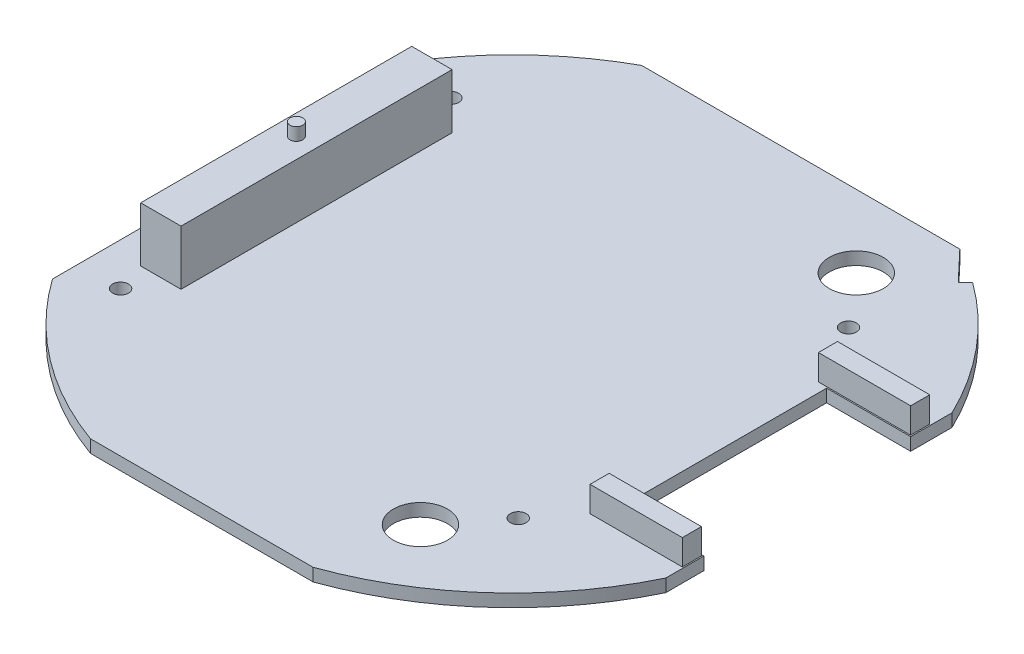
ISO-10303-21;
HEADER;
FILE_DESCRIPTION(('STEP AP214'),'2;1');
FILE_NAME('part.step','',(''),(''),'','','');
FILE_SCHEMA(('AUTOMOTIVE_DESIGN { 1 0 10303 214 1 1 1 1 }'));
ENDSEC;
DATA;
#1=APPLICATION_CONTEXT('core data for automotive mechanical design processes');
#2=APPLICATION_PROTOCOL_DEFINITION('international standard','automotive_design',2000,#1);
#3=PRODUCT_CONTEXT('',#1,'mechanical');
#4=PRODUCT('Part','Part','',(#3));
#5=PRODUCT_RELATED_PRODUCT_CATEGORY('part','',(#4));
#6=PRODUCT_DEFINITION_FORMATION('','',#4);
#7=PRODUCT_DEFINITION_CONTEXT('part definition',#1,'design');
#8=PRODUCT_DEFINITION('design','',#6,#7);
#9=PRODUCT_DEFINITION_SHAPE('','',#8);
#10=(LENGTH_UNIT() NAMED_UNIT(*) SI_UNIT(.MILLI.,.METRE.));
#11=(NAMED_UNIT(*) PLANE_ANGLE_UNIT() SI_UNIT($,.RADIAN.));
#12=(NAMED_UNIT(*) SI_UNIT($,.STERADIAN.) SOLID_ANGLE_UNIT());
#13=UNCERTAINTY_MEASURE_WITH_UNIT(LENGTH_MEASURE(1.E-05),#10,'distance_accuracy_value','');
#14=(GEOMETRIC_REPRESENTATION_CONTEXT(3) GLOBAL_UNCERTAINTY_ASSIGNED_CONTEXT((#13)) GLOBAL_UNIT_ASSIGNED_CONTEXT((#10,
#11,#12)) REPRESENTATION_CONTEXT('',''));
#15=CARTESIAN_POINT('',(0.,0.,0.));
#16=DIRECTION('',(0.,0.,1.));
#17=DIRECTION('',(1.,0.,0.));
#18=AXIS2_PLACEMENT_3D('',#15,#16,#17);
#19=CARTESIAN_POINT('',(0.,13.462,0.));
#20=DIRECTION('',(0.,1.,0.));
#21=DIRECTION('',(0.,0.,1.));
#22=AXIS2_PLACEMENT_3D('',#19,#20,#21);
#23=PLANE('',#22);
#24=DIRECTION('',(0.,0.,1.));
#25=VECTOR('',#24,1.);
#26=CARTESIAN_POINT('',(-47.0769015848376,13.462,-27.051));
#27=LINE('',#26,#25);
#28=CARTESIAN_POINT('',(-47.0769015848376,13.462,-27.051));
#29=VERTEX_POINT('',#28);
#30=CARTESIAN_POINT('',(-47.0769015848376,13.462,27.051));
#31=VERTEX_POINT('',#30);
#32=EDGE_CURVE('E295',#29,#31,#27,.T.);
#33=ORIENTED_EDGE('',*,*,#32,.T.);
#34=DIRECTION('',(1.,0.,0.));
#35=VECTOR('',#34,1.);
#36=CARTESIAN_POINT('',(-47.0769015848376,13.462,27.051));
#37=LINE('',#36,#35);
#38=CARTESIAN_POINT('',(-39.0251015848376,13.462,27.051));
#39=VERTEX_POINT('',#38);
#40=EDGE_CURVE('E298',#31,#39,#37,.T.);
#41=ORIENTED_EDGE('',*,*,#40,.T.);
#42=DIRECTION('',(0.,0.,-1.));
#43=VECTOR('',#42,1.);
#44=CARTESIAN_POINT('',(-39.0251015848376,13.462,-27.051));
#45=LINE('',#44,#43);
#46=CARTESIAN_POINT('',(-39.0251015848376,13.462,-27.051));
#47=VERTEX_POINT('',#46);
#48=EDGE_CURVE('E301',#39,#47,#45,.T.);
#49=ORIENTED_EDGE('',*,*,#48,.T.);
#50=DIRECTION('',(-1.,0.,0.));
#51=VECTOR('',#50,1.);
#52=CARTESIAN_POINT('',(-47.0769015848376,13.462,-27.051));
#53=LINE('',#52,#51);
#54=EDGE_CURVE('E303',#47,#29,#53,.T.);
#55=ORIENTED_EDGE('',*,*,#54,.T.);
#56=EDGE_LOOP('',(#33,#41,#49,#55));
#57=FACE_BOUND('',#56,.T.);
#58=CARTESIAN_POINT('',(-43.0510015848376,13.462,0.));
#59=DIRECTION('',(0.,1.,0.));
#60=DIRECTION('',(0.,0.,1.));
#61=AXIS2_PLACEMENT_3D('',#58,#59,#60);
#62=CIRCLE('',#61,1.27);
#63=CARTESIAN_POINT('',(-43.0510015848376,13.462,1.27));
#64=VERTEX_POINT('',#63);
#65=EDGE_CURVE('E978',#64,#64,#62,.T.);
#66=ORIENTED_EDGE('',*,*,#65,.F.);
#67=EDGE_LOOP('',(#66));
#68=FACE_BOUND('',#67,.T.);
#69=ADVANCED_FACE('F32',(#57,#68),#23,.T.);
#70=CARTESIAN_POINT('',(0.,2.54,0.));
#71=DIRECTION('',(0.,1.,0.));
#72=DIRECTION('',(0.,0.,1.));
#73=AXIS2_PLACEMENT_3D('',#70,#71,#72);
#74=PLANE('',#73);
#75=CARTESIAN_POINT('',(25.5374462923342,2.54,43.8277));
#76=DIRECTION('',(0.,1.,0.));
#77=DIRECTION('',(0.,0.,1.));
#78=AXIS2_PLACEMENT_3D('',#75,#76,#77);
#79=CIRCLE('',#78,5.3975);
#80=CARTESIAN_POINT('',(25.5374462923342,2.54,49.2252));
#81=VERTEX_POINT('',#80);
#82=EDGE_CURVE('E970',#81,#81,#79,.T.);
#83=ORIENTED_EDGE('',*,*,#82,.F.);
#84=EDGE_LOOP('',(#83));
#85=FACE_BOUND('',#84,.T.);
#86=CARTESIAN_POINT('',(25.5374462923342,2.54,-43.1673));
#87=DIRECTION('',(0.,1.,0.));
#88=DIRECTION('',(0.,0.,1.));
#89=AXIS2_PLACEMENT_3D('',#86,#87,#88);
#90=CIRCLE('',#89,5.3975);
#91=CARTESIAN_POINT('',(25.5374462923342,2.54,-37.7698));
#92=VERTEX_POINT('',#91);
#93=EDGE_CURVE('E972',#92,#92,#90,.T.);
#94=ORIENTED_EDGE('',*,*,#93,.F.);
#95=EDGE_LOOP('',(#94));
#96=FACE_BOUND('',#95,.T.);
#97=DIRECTION('',(1.,0.,0.));
#98=VECTOR('',#97,1.);
#99=CARTESIAN_POINT('',(40.5869462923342,2.54,-20.5486));
#100=LINE('',#99,#98);
#101=CARTESIAN_POINT('',(40.5869462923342,2.54,-20.5486));
#102=VERTEX_POINT('',#101);
#103=CARTESIAN_POINT('',(59.0019462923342,2.54,-20.5486));
#104=VERTEX_POINT('',#103);
#105=EDGE_CURVE('E267',#102,#104,#100,.T.);
#106=ORIENTED_EDGE('',*,*,#105,.F.);
#107=DIRECTION('',(0.,0.,1.));
#108=VECTOR('',#107,1.);
#109=CARTESIAN_POINT('',(40.5869462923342,2.54,-24.3586));
#110=LINE('',#109,#108);
#111=CARTESIAN_POINT('',(40.5869462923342,2.54,-24.3586));
#112=VERTEX_POINT('',#111);
#113=EDGE_CURVE('E264',#112,#102,#110,.T.);
#114=ORIENTED_EDGE('',*,*,#113,.F.);
#115=DIRECTION('',(-1.,0.,0.));
#116=VECTOR('',#115,1.);
#117=CARTESIAN_POINT('',(40.5869462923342,2.54,-24.3586));
#118=LINE('',#117,#116);
#119=CARTESIAN_POINT('',(59.0019462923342,2.54,-24.3586));
#120=VERTEX_POINT('',#119);
#121=EDGE_CURVE('E276',#120,#112,#118,.T.);
#122=ORIENTED_EDGE('',*,*,#121,.F.);
#123=DIRECTION('',(0.,0.,-1.));
#124=VECTOR('',#123,1.);
#125=CARTESIAN_POINT('',(59.0019462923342,2.54,-24.3586));
#126=LINE('',#125,#124);
#127=EDGE_CURVE('E284',#104,#120,#126,.T.);
#128=ORIENTED_EDGE('',*,*,#127,.F.);
#129=EDGE_LOOP('',(#106,#114,#122,#128));
#130=FACE_BOUND('',#129,.T.);
#131=DIRECTION('',(0.,0.,1.));
#132=VECTOR('',#131,1.);
#133=CARTESIAN_POINT('',(-47.0769015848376,2.54,-27.051));
#134=LINE('',#133,#132);
#135=CARTESIAN_POINT('',(-47.0769015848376,2.54,-27.051));
#136=VERTEX_POINT('',#135);
#137=CARTESIAN_POINT('',(-47.0769015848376,2.54,-3.11458275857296));
#138=VERTEX_POINT('',#137);
#139=EDGE_CURVE('E42',#136,#138,#134,.T.);
#140=ORIENTED_EDGE('',*,*,#139,.F.);
#141=DIRECTION('',(-1.,0.,0.));
#142=VECTOR('',#141,1.);
#143=CARTESIAN_POINT('',(-47.0769015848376,2.54,-27.051));
#144=LINE('',#143,#142);
#145=CARTESIAN_POINT('',(-39.0251015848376,2.54,-27.051));
#146=VERTEX_POINT('',#145);
#147=EDGE_CURVE('E299',#146,#136,#144,.T.);
#148=ORIENTED_EDGE('',*,*,#147,.F.);
#149=DIRECTION('',(0.,0.,-1.));
#150=VECTOR('',#149,1.);
#151=CARTESIAN_POINT('',(-39.0251015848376,2.54,-27.051));
#152=LINE('',#151,#150);
#153=CARTESIAN_POINT('',(-39.0251015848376,2.54,27.051));
#154=VERTEX_POINT('',#153);
#155=EDGE_CURVE('E310',#154,#146,#152,.T.);
#156=ORIENTED_EDGE('',*,*,#155,.F.);
#157=DIRECTION('',(1.,0.,0.));
#158=VECTOR('',#157,1.);
#159=CARTESIAN_POINT('',(-47.0769015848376,2.54,27.051));
#160=LINE('',#159,#158);
#161=CARTESIAN_POINT('',(-47.0769015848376,2.54,27.051));
#162=VERTEX_POINT('',#161);
#163=EDGE_CURVE('E307',#162,#154,#160,.T.);
#164=ORIENTED_EDGE('',*,*,#163,.F.);
#165=CARTESIAN_POINT('',(-47.0769015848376,2.54,3.11458275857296));
#166=VERTEX_POINT('',#165);
#167=EDGE_CURVE('E11',#166,#162,#134,.T.);
#168=ORIENTED_EDGE('',*,*,#167,.F.);
#169=CARTESIAN_POINT('',(-51.0901015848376,2.54,0.));
#170=DIRECTION('',(0.,-1.,0.));
#171=DIRECTION('',(0.,0.,1.));
#172=AXIS2_PLACEMENT_3D('',#169,#170,#171);
#173=CIRCLE('',#172,5.08000000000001);
#174=CARTESIAN_POINT('',(-51.0901015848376,2.54,5.08));
#175=VERTEX_POINT('',#174);
#176=EDGE_CURVE('E367',#166,#175,#173,.T.);
#177=ORIENTED_EDGE('',*,*,#176,.T.);
#178=DIRECTION('',(-1.,0.,0.));
#179=VECTOR('',#178,1.);
#180=CARTESIAN_POINT('',(-53.6301015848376,2.54,5.08));
#181=LINE('',#180,#179);
#182=CARTESIAN_POINT('',(-53.6301015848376,2.54,5.08));
#183=VERTEX_POINT('',#182);
#184=EDGE_CURVE('E371',#175,#183,#181,.T.);
#185=ORIENTED_EDGE('',*,*,#184,.T.);
#186=DIRECTION('',(0.,0.,1.));
#187=VECTOR('',#186,1.);
#188=CARTESIAN_POINT('',(-53.6301015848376,2.54,5.08));
#189=LINE('',#188,#187);
#190=CARTESIAN_POINT('',(-53.6301015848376,2.54,38.1));
#191=VERTEX_POINT('',#190);
#192=EDGE_CURVE('E374',#183,#191,#189,.T.);
#193=ORIENTED_EDGE('',*,*,#192,.T.);
#194=CARTESIAN_POINT('',(0.,2.54,0.));
#195=DIRECTION('',(0.,1.,0.));
#196=DIRECTION('',(0.,0.,1.));
#197=AXIS2_PLACEMENT_3D('',#194,#195,#196);
#198=CIRCLE('',#197,65.786);
#199=CARTESIAN_POINT('',(-22.225,2.54,61.918068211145));
#200=VERTEX_POINT('',#199);
#201=EDGE_CURVE('E376',#191,#200,#198,.T.);
#202=ORIENTED_EDGE('',*,*,#201,.T.);
#203=DIRECTION('',(1.,0.,0.));
#204=VECTOR('',#203,1.);
#205=CARTESIAN_POINT('',(-22.225,2.54,61.918068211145));
#206=LINE('',#205,#204);
#207=CARTESIAN_POINT('',(22.225,2.54,61.918068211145));
#208=VERTEX_POINT('',#207);
#209=EDGE_CURVE('E378',#200,#208,#206,.T.);
#210=ORIENTED_EDGE('',*,*,#209,.T.);
#211=CARTESIAN_POINT('',(0.,2.54,0.));
#212=DIRECTION('',(0.,1.,0.));
#213=DIRECTION('',(0.,0.,1.));
#214=AXIS2_PLACEMENT_3D('',#211,#212,#213);
#215=CIRCLE('',#214,65.786);
#216=CARTESIAN_POINT('',(59.2559462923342,2.54,28.575));
#217=VERTEX_POINT('',#216);
#218=EDGE_CURVE('E380',#208,#217,#215,.T.);
#219=ORIENTED_EDGE('',*,*,#218,.T.);
#220=DIRECTION('',(0.,0.,-1.));
#221=VECTOR('',#220,1.);
#222=CARTESIAN_POINT('',(59.2559462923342,2.54,20.955));
#223=LINE('',#222,#221);
#224=CARTESIAN_POINT('',(59.2559462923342,2.54,20.955));
#225=VERTEX_POINT('',#224);
#226=EDGE_CURVE('E382',#217,#225,#223,.T.);
#227=ORIENTED_EDGE('',*,*,#226,.T.);
#228=DIRECTION('',(-1.,0.,0.));
#229=VECTOR('',#228,1.);
#230=CARTESIAN_POINT('',(42.4919462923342,2.54,20.955));
#231=LINE('',#230,#229);
#232=CARTESIAN_POINT('',(42.4919462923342,2.54,20.955));
#233=VERTEX_POINT('',#232);
#234=EDGE_CURVE('E384',#225,#233,#231,.T.);
#235=ORIENTED_EDGE('',*,*,#234,.T.);
#236=DIRECTION('',(0.,0.,-1.));
#237=VECTOR('',#236,1.);
#238=CARTESIAN_POINT('',(42.4919462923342,2.54,-20.2946));
#239=LINE('',#238,#237);
#240=CARTESIAN_POINT('',(42.4919462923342,2.54,-20.2946));
#241=VERTEX_POINT('',#240);
#242=EDGE_CURVE('E386',#233,#241,#239,.T.);
#243=ORIENTED_EDGE('',*,*,#242,.T.);
#244=DIRECTION('',(1.,0.,0.));
#245=VECTOR('',#244,1.);
#246=CARTESIAN_POINT('',(59.2559462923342,2.54,-20.2946));
#247=LINE('',#246,#245);
#248=CARTESIAN_POINT('',(59.2559462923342,2.54,-20.2946));
#249=VERTEX_POINT('',#248);
#250=EDGE_CURVE('E388',#241,#249,#247,.T.);
#251=ORIENTED_EDGE('',*,*,#250,.T.);
#252=DIRECTION('',(0.,0.,-1.));
#253=VECTOR('',#252,1.);
#254=CARTESIAN_POINT('',(59.2559462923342,2.54,-28.575));
#255=LINE('',#254,#253);
#256=CARTESIAN_POINT('',(59.2559462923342,2.54,-28.575));
#257=VERTEX_POINT('',#256);
#258=EDGE_CURVE('E390',#249,#257,#255,.T.);
#259=ORIENTED_EDGE('',*,*,#258,.T.);
#260=CARTESIAN_POINT('',(0.,2.54,0.));
#261=DIRECTION('',(0.,1.,0.));
#262=DIRECTION('',(0.,0.,1.));
#263=AXIS2_PLACEMENT_3D('',#260,#261,#262);
#264=CIRCLE('',#263,65.786);
#265=CARTESIAN_POINT('',(38.8154375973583,2.54,-53.1145893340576));
#266=VERTEX_POINT('',#265);
#267=EDGE_CURVE('E351',#257,#266,#264,.T.);
#268=ORIENTED_EDGE('',*,*,#267,.T.);
#269=DIRECTION('',(-0.725904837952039,0.,0.687795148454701));
#270=VECTOR('',#269,1.);
#271=CARTESIAN_POINT('',(37.3403989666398,2.54,-51.7169895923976));
#272=LINE('',#271,#270);
#273=CARTESIAN_POINT('',(37.3403989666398,2.54,-51.7169895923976));
#274=VERTEX_POINT('',#273);
#275=EDGE_CURVE('E354',#266,#274,#272,.T.);
#276=ORIENTED_EDGE('',*,*,#275,.T.);
#277=DIRECTION('',(-0.687795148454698,0.,-0.725904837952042));
#278=VECTOR('',#277,1.);
#279=CARTESIAN_POINT('',(31.75,2.54,-57.6171441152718));
#280=LINE('',#279,#278);
#281=CARTESIAN_POINT('',(31.75,2.54,-57.6171441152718));
#282=VERTEX_POINT('',#281);
#283=EDGE_CURVE('E357',#274,#282,#280,.T.);
#284=ORIENTED_EDGE('',*,*,#283,.T.);
#285=DIRECTION('',(-1.,0.,0.));
#286=VECTOR('',#285,1.);
#287=CARTESIAN_POINT('',(-31.75,2.54,-57.6171441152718));
#288=LINE('',#287,#286);
#289=CARTESIAN_POINT('',(-31.75,2.54,-57.6171441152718));
#290=VERTEX_POINT('',#289);
#291=EDGE_CURVE('E359',#282,#290,#288,.T.);
#292=ORIENTED_EDGE('',*,*,#291,.T.);
#293=CARTESIAN_POINT('',(0.,2.54,0.));
#294=DIRECTION('',(0.,1.,0.));
#295=DIRECTION('',(0.,0.,1.));
#296=AXIS2_PLACEMENT_3D('',#293,#294,#295);
#297=CIRCLE('',#296,65.786);
#298=CARTESIAN_POINT('',(-53.6301015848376,2.54,-38.1));
#299=VERTEX_POINT('',#298);
#300=EDGE_CURVE('E361',#290,#299,#297,.T.);
#301=ORIENTED_EDGE('',*,*,#300,.T.);
#302=DIRECTION('',(0.,0.,1.));
#303=VECTOR('',#302,1.);
#304=CARTESIAN_POINT('',(-53.6301015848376,2.54,-38.1));
#305=LINE('',#304,#303);
#306=CARTESIAN_POINT('',(-53.6301015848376,2.54,-5.08000000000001));
#307=VERTEX_POINT('',#306);
#308=EDGE_CURVE('E363',#299,#307,#305,.T.);
#309=ORIENTED_EDGE('',*,*,#308,.T.);
#310=DIRECTION('',(1.,0.,0.));
#311=VECTOR('',#310,1.);
#312=CARTESIAN_POINT('',(-51.0901015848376,2.54,-5.08000000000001));
#313=LINE('',#312,#311);
#314=CARTESIAN_POINT('',(-51.0901015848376,2.54,-5.08000000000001));
#315=VERTEX_POINT('',#314);
#316=EDGE_CURVE('E365',#307,#315,#313,.T.);
#317=ORIENTED_EDGE('',*,*,#316,.T.);
#318=EDGE_CURVE('E368',#315,#138,#173,.T.);
#319=ORIENTED_EDGE('',*,*,#318,.T.);
#320=EDGE_LOOP('',(#140,#148,#156,#164,#168,#177,#185,#193,#202,#210,#219,#227,#235,#243,#251,
#259,#268,#276,#284,#292,#301,#309,#317,#319));
#321=FACE_BOUND('',#320,.T.);
#322=CARTESIAN_POINT('',(34.1903984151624,2.54,-32.9565));
#323=DIRECTION('',(0.,1.,0.));
#324=DIRECTION('',(0.,0.,1.));
#325=AXIS2_PLACEMENT_3D('',#322,#323,#324);
#326=CIRCLE('',#325,1.5875);
#327=CARTESIAN_POINT('',(34.1903984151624,2.54,-31.369));
#328=VERTEX_POINT('',#327);
#329=EDGE_CURVE('E333',#328,#328,#326,.T.);
#330=ORIENTED_EDGE('',*,*,#329,.F.);
#331=EDGE_LOOP('',(#330));
#332=FACE_BOUND('',#331,.T.);
#333=CARTESIAN_POINT('',(-45.1846015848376,2.54,-32.9565));
#334=DIRECTION('',(0.,1.,0.));
#335=DIRECTION('',(0.,0.,1.));
#336=AXIS2_PLACEMENT_3D('',#333,#334,#335);
#337=CIRCLE('',#336,1.5875);
#338=CARTESIAN_POINT('',(-45.1846015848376,2.54,-31.369));
#339=VERTEX_POINT('',#338);
#340=EDGE_CURVE('E345',#339,#339,#337,.T.);
#341=ORIENTED_EDGE('',*,*,#340,.F.);
#342=EDGE_LOOP('',(#341));
#343=FACE_BOUND('',#342,.T.);
#344=CARTESIAN_POINT('',(-45.1846015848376,2.54,32.9565));
#345=DIRECTION('',(0.,1.,0.));
#346=DIRECTION('',(0.,0.,1.));
#347=AXIS2_PLACEMENT_3D('',#344,#345,#346);
#348=CIRCLE('',#347,1.5875);
#349=CARTESIAN_POINT('',(-45.1846015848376,2.54,34.544));
#350=VERTEX_POINT('',#349);
#351=EDGE_CURVE('E339',#350,#350,#348,.T.);
#352=ORIENTED_EDGE('',*,*,#351,.F.);
#353=EDGE_LOOP('',(#352));
#354=FACE_BOUND('',#353,.T.);
#355=CARTESIAN_POINT('',(34.1903984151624,2.54,32.9565));
#356=DIRECTION('',(0.,1.,0.));
#357=DIRECTION('',(0.,0.,1.));
#358=AXIS2_PLACEMENT_3D('',#355,#356,#357);
#359=CIRCLE('',#358,1.5875);
#360=CARTESIAN_POINT('',(34.1903984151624,2.54,34.544));
#361=VERTEX_POINT('',#360);
#362=EDGE_CURVE('E327',#361,#361,#359,.T.);
#363=ORIENTED_EDGE('',*,*,#362,.F.);
#364=EDGE_LOOP('',(#363));
#365=FACE_BOUND('',#364,.T.);
#366=DIRECTION('',(1.,0.,0.));
#367=VECTOR('',#366,1.);
#368=CARTESIAN_POINT('',(40.5869462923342,2.54,25.019));
#369=LINE('',#368,#367);
#370=CARTESIAN_POINT('',(40.5869462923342,2.54,25.019));
#371=VERTEX_POINT('',#370);
#372=CARTESIAN_POINT('',(59.0019462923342,2.54,25.019));
#373=VERTEX_POINT('',#372);
#374=EDGE_CURVE('E990',#371,#373,#369,.T.);
#375=ORIENTED_EDGE('',*,*,#374,.F.);
#376=DIRECTION('',(0.,0.,1.));
#377=VECTOR('',#376,1.);
#378=CARTESIAN_POINT('',(40.5869462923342,2.54,25.019));
#379=LINE('',#378,#377);
#380=CARTESIAN_POINT('',(40.5869462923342,2.54,21.209));
#381=VERTEX_POINT('',#380);
#382=EDGE_CURVE('E262',#381,#371,#379,.T.);
#383=ORIENTED_EDGE('',*,*,#382,.F.);
#384=DIRECTION('',(-1.,0.,0.));
#385=VECTOR('',#384,1.);
#386=CARTESIAN_POINT('',(40.5869462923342,2.54,21.209));
#387=LINE('',#386,#385);
#388=CARTESIAN_POINT('',(59.0019462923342,2.54,21.209));
#389=VERTEX_POINT('',#388);
#390=EDGE_CURVE('E258',#389,#381,#387,.T.);
#391=ORIENTED_EDGE('',*,*,#390,.F.);
#392=DIRECTION('',(0.,0.,-1.));
#393=VECTOR('',#392,1.);
#394=CARTESIAN_POINT('',(59.0019462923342,2.54,25.019));
#395=LINE('',#394,#393);
#396=EDGE_CURVE('E992',#373,#389,#395,.T.);
#397=ORIENTED_EDGE('',*,*,#396,.F.);
#398=EDGE_LOOP('',(#375,#383,#391,#397));
#399=FACE_BOUND('',#398,.T.);
#400=ADVANCED_FACE('F503',(#85,#96,#130,#321,#332,#343,#354,#365,#399),#74,.T.);
#401=CARTESIAN_POINT('',(0.,0.,0.));
#402=DIRECTION('',(0.,1.,0.));
#403=DIRECTION('',(0.,0.,1.));
#404=AXIS2_PLACEMENT_3D('',#401,#402,#403);
#405=PLANE('',#404);
#406=CARTESIAN_POINT('',(25.5374462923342,0.,43.8277));
#407=DIRECTION('',(0.,1.,0.));
#408=DIRECTION('',(0.,0.,1.));
#409=AXIS2_PLACEMENT_3D('',#406,#407,#408);
#410=CIRCLE('',#409,5.3975);
#411=CARTESIAN_POINT('',(25.5374462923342,0.,49.2252));
#412=VERTEX_POINT('',#411);
#413=EDGE_CURVE('E967',#412,#412,#410,.T.);
#414=ORIENTED_EDGE('',*,*,#413,.T.);
#415=EDGE_LOOP('',(#414));
#416=FACE_BOUND('',#415,.T.);
#417=CARTESIAN_POINT('',(25.5374462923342,0.,-43.1673));
#418=DIRECTION('',(0.,1.,0.));
#419=DIRECTION('',(0.,0.,1.));
#420=AXIS2_PLACEMENT_3D('',#417,#418,#419);
#421=CIRCLE('',#420,5.3975);
#422=CARTESIAN_POINT('',(25.5374462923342,0.,-37.7698));
#423=VERTEX_POINT('',#422);
#424=EDGE_CURVE('E975',#423,#423,#421,.T.);
#425=ORIENTED_EDGE('',*,*,#424,.T.);
#426=EDGE_LOOP('',(#425));
#427=FACE_BOUND('',#426,.T.);
#428=CARTESIAN_POINT('',(34.1903984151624,0.,-32.9565));
#429=DIRECTION('',(0.,1.,0.));
#430=DIRECTION('',(0.,0.,1.));
#431=AXIS2_PLACEMENT_3D('',#428,#429,#430);
#432=CIRCLE('',#431,1.5875);
#433=CARTESIAN_POINT('',(34.1903984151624,0.,-31.369));
#434=VERTEX_POINT('',#433);
#435=EDGE_CURVE('E330',#434,#434,#432,.T.);
#436=ORIENTED_EDGE('',*,*,#435,.T.);
#437=EDGE_LOOP('',(#436));
#438=FACE_BOUND('',#437,.T.);
#439=CARTESIAN_POINT('',(-45.1846015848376,0.,-32.9565));
#440=DIRECTION('',(0.,1.,0.));
#441=DIRECTION('',(0.,0.,1.));
#442=AXIS2_PLACEMENT_3D('',#439,#440,#441);
#443=CIRCLE('',#442,1.5875);
#444=CARTESIAN_POINT('',(-45.1846015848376,0.,-31.369));
#445=VERTEX_POINT('',#444);
#446=EDGE_CURVE('E342',#445,#445,#443,.T.);
#447=ORIENTED_EDGE('',*,*,#446,.T.);
#448=EDGE_LOOP('',(#447));
#449=FACE_BOUND('',#448,.T.);
#450=CARTESIAN_POINT('',(0.,0.,0.));
#451=DIRECTION('',(0.,1.,0.));
#452=DIRECTION('',(0.,0.,1.));
#453=AXIS2_PLACEMENT_3D('',#450,#451,#452);
#454=CIRCLE('',#453,65.786);
#455=CARTESIAN_POINT('',(59.2559462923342,0.,-28.575));
#456=VERTEX_POINT('',#455);
#457=CARTESIAN_POINT('',(38.8154375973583,0.,-53.1145893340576));
#458=VERTEX_POINT('',#457);
#459=EDGE_CURVE('E348',#456,#458,#454,.T.);
#460=ORIENTED_EDGE('',*,*,#459,.F.);
#461=DIRECTION('',(0.,0.,-1.));
#462=VECTOR('',#461,1.);
#463=CARTESIAN_POINT('',(59.2559462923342,0.,-28.575));
#464=LINE('',#463,#462);
#465=CARTESIAN_POINT('',(59.2559462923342,0.,-20.2946));
#466=VERTEX_POINT('',#465);
#467=EDGE_CURVE('E355',#466,#456,#464,.T.);
#468=ORIENTED_EDGE('',*,*,#467,.F.);
#469=DIRECTION('',(1.,0.,0.));
#470=VECTOR('',#469,1.);
#471=CARTESIAN_POINT('',(59.2559462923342,0.,-20.2946));
#472=LINE('',#471,#470);
#473=CARTESIAN_POINT('',(42.4919462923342,0.,-20.2946));
#474=VERTEX_POINT('',#473);
#475=EDGE_CURVE('E425',#474,#466,#472,.T.);
#476=ORIENTED_EDGE('',*,*,#475,.F.);
#477=DIRECTION('',(0.,0.,-1.));
#478=VECTOR('',#477,1.);
#479=CARTESIAN_POINT('',(42.4919462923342,0.,-20.2946));
#480=LINE('',#479,#478);
#481=CARTESIAN_POINT('',(42.4919462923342,0.,20.955));
#482=VERTEX_POINT('',#481);
#483=EDGE_CURVE('E423',#482,#474,#480,.T.);
#484=ORIENTED_EDGE('',*,*,#483,.F.);
#485=DIRECTION('',(-1.,0.,0.));
#486=VECTOR('',#485,1.);
#487=CARTESIAN_POINT('',(42.4919462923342,0.,20.955));
#488=LINE('',#487,#486);
#489=CARTESIAN_POINT('',(59.2559462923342,0.,20.955));
#490=VERTEX_POINT('',#489);
#491=EDGE_CURVE('E421',#490,#482,#488,.T.);
#492=ORIENTED_EDGE('',*,*,#491,.F.);
#493=DIRECTION('',(0.,0.,-1.));
#494=VECTOR('',#493,1.);
#495=CARTESIAN_POINT('',(59.2559462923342,0.,20.955));
#496=LINE('',#495,#494);
#497=CARTESIAN_POINT('',(59.2559462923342,0.,28.575));
#498=VERTEX_POINT('',#497);
#499=EDGE_CURVE('E419',#498,#490,#496,.T.);
#500=ORIENTED_EDGE('',*,*,#499,.F.);
#501=CARTESIAN_POINT('',(0.,0.,0.));
#502=DIRECTION('',(0.,1.,0.));
#503=DIRECTION('',(0.,0.,1.));
#504=AXIS2_PLACEMENT_3D('',#501,#502,#503);
#505=CIRCLE('',#504,65.786);
#506=CARTESIAN_POINT('',(22.225,0.,61.918068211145));
#507=VERTEX_POINT('',#506);
#508=EDGE_CURVE('E417',#507,#498,#505,.T.);
#509=ORIENTED_EDGE('',*,*,#508,.F.);
#510=DIRECTION('',(1.,0.,0.));
#511=VECTOR('',#510,1.);
#512=CARTESIAN_POINT('',(-22.225,0.,61.918068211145));
#513=LINE('',#512,#511);
#514=CARTESIAN_POINT('',(-22.225,0.,61.918068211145));
#515=VERTEX_POINT('',#514);
#516=EDGE_CURVE('E415',#515,#507,#513,.T.);
#517=ORIENTED_EDGE('',*,*,#516,.F.);
#518=CARTESIAN_POINT('',(0.,0.,0.));
#519=DIRECTION('',(0.,1.,0.));
#520=DIRECTION('',(0.,0.,1.));
#521=AXIS2_PLACEMENT_3D('',#518,#519,#520);
#522=CIRCLE('',#521,65.786);
#523=CARTESIAN_POINT('',(-53.6301015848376,0.,38.1));
#524=VERTEX_POINT('',#523);
#525=EDGE_CURVE('E413',#524,#515,#522,.T.);
#526=ORIENTED_EDGE('',*,*,#525,.F.);
#527=DIRECTION('',(0.,0.,1.));
#528=VECTOR('',#527,1.);
#529=CARTESIAN_POINT('',(-53.6301015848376,0.,5.08));
#530=LINE('',#529,#528);
#531=CARTESIAN_POINT('',(-53.6301015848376,0.,5.08));
#532=VERTEX_POINT('',#531);
#533=EDGE_CURVE('E411',#532,#524,#530,.T.);
#534=ORIENTED_EDGE('',*,*,#533,.F.);
#535=DIRECTION('',(-1.,0.,0.));
#536=VECTOR('',#535,1.);
#537=CARTESIAN_POINT('',(-53.6301015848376,0.,5.08));
#538=LINE('',#537,#536);
#539=CARTESIAN_POINT('',(-51.0901015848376,0.,5.08));
#540=VERTEX_POINT('',#539);
#541=EDGE_CURVE('E409',#540,#532,#538,.T.);
#542=ORIENTED_EDGE('',*,*,#541,.F.);
#543=CARTESIAN_POINT('',(-51.0901015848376,0.,0.));
#544=DIRECTION('',(0.,-1.,0.));
#545=DIRECTION('',(0.,0.,1.));
#546=AXIS2_PLACEMENT_3D('',#543,#544,#545);
#547=CIRCLE('',#546,5.08000000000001);
#548=CARTESIAN_POINT('',(-51.0901015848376,0.,-5.08000000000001));
#549=VERTEX_POINT('',#548);
#550=EDGE_CURVE('E407',#549,#540,#547,.T.);
#551=ORIENTED_EDGE('',*,*,#550,.F.);
#552=DIRECTION('',(1.,0.,0.));
#553=VECTOR('',#552,1.);
#554=CARTESIAN_POINT('',(-51.0901015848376,0.,-5.08000000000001));
#555=LINE('',#554,#553);
#556=CARTESIAN_POINT('',(-53.6301015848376,0.,-5.08000000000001));
#557=VERTEX_POINT('',#556);
#558=EDGE_CURVE('E405',#557,#549,#555,.T.);
#559=ORIENTED_EDGE('',*,*,#558,.F.);
#560=DIRECTION('',(0.,0.,1.));
#561=VECTOR('',#560,1.);
#562=CARTESIAN_POINT('',(-53.6301015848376,0.,-38.1));
#563=LINE('',#562,#561);
#564=CARTESIAN_POINT('',(-53.6301015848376,0.,-38.1));
#565=VERTEX_POINT('',#564);
#566=EDGE_CURVE('E403',#565,#557,#563,.T.);
#567=ORIENTED_EDGE('',*,*,#566,.F.);
#568=CARTESIAN_POINT('',(0.,0.,0.));
#569=DIRECTION('',(0.,1.,0.));
#570=DIRECTION('',(0.,0.,1.));
#571=AXIS2_PLACEMENT_3D('',#568,#569,#570);
#572=CIRCLE('',#571,65.786);
#573=CARTESIAN_POINT('',(-31.75,0.,-57.6171441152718));
#574=VERTEX_POINT('',#573);
#575=EDGE_CURVE('E401',#574,#565,#572,.T.);
#576=ORIENTED_EDGE('',*,*,#575,.F.);
#577=DIRECTION('',(-1.,0.,0.));
#578=VECTOR('',#577,1.);
#579=CARTESIAN_POINT('',(-31.75,0.,-57.6171441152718));
#580=LINE('',#579,#578);
#581=CARTESIAN_POINT('',(31.75,0.,-57.6171441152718));
#582=VERTEX_POINT('',#581);
#583=EDGE_CURVE('E399',#582,#574,#580,.T.);
#584=ORIENTED_EDGE('',*,*,#583,.F.);
#585=DIRECTION('',(-0.687795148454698,0.,-0.725904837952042));
#586=VECTOR('',#585,1.);
#587=CARTESIAN_POINT('',(31.75,0.,-57.6171441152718));
#588=LINE('',#587,#586);
#589=CARTESIAN_POINT('',(37.3403989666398,0.,-51.7169895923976));
#590=VERTEX_POINT('',#589);
#591=EDGE_CURVE('E397',#590,#582,#588,.T.);
#592=ORIENTED_EDGE('',*,*,#591,.F.);
#593=DIRECTION('',(-0.725904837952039,0.,0.687795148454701));
#594=VECTOR('',#593,1.);
#595=CARTESIAN_POINT('',(37.3403989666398,0.,-51.7169895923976));
#596=LINE('',#595,#594);
#597=EDGE_CURVE('E395',#458,#590,#596,.T.);
#598=ORIENTED_EDGE('',*,*,#597,.F.);
#599=EDGE_LOOP('',(#460,#468,#476,#484,#492,#500,#509,#517,#526,#534,#542,#551,#559,#567,#576,
#584,#592,#598));
#600=FACE_BOUND('',#599,.T.);
#601=CARTESIAN_POINT('',(-45.1846015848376,0.,32.9565));
#602=DIRECTION('',(0.,1.,0.));
#603=DIRECTION('',(0.,0.,1.));
#604=AXIS2_PLACEMENT_3D('',#601,#602,#603);
#605=CIRCLE('',#604,1.5875);
#606=CARTESIAN_POINT('',(-45.1846015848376,0.,34.544));
#607=VERTEX_POINT('',#606);
#608=EDGE_CURVE('E336',#607,#607,#605,.T.);
#609=ORIENTED_EDGE('',*,*,#608,.T.);
#610=EDGE_LOOP('',(#609));
#611=FACE_BOUND('',#610,.T.);
#612=CARTESIAN_POINT('',(34.1903984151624,0.,32.9565));
#613=DIRECTION('',(0.,1.,0.));
#614=DIRECTION('',(0.,0.,1.));
#615=AXIS2_PLACEMENT_3D('',#612,#613,#614);
#616=CIRCLE('',#615,1.5875);
#617=CARTESIAN_POINT('',(34.1903984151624,0.,34.544));
#618=VERTEX_POINT('',#617);
#619=EDGE_CURVE('E326',#618,#618,#616,.T.);
#620=ORIENTED_EDGE('',*,*,#619,.T.);
#621=EDGE_LOOP('',(#620));
#622=FACE_BOUND('',#621,.T.);
#623=ADVANCED_FACE('F490',(#416,#427,#438,#449,#600,#611,#622),#405,.F.);
#624=CARTESIAN_POINT('',(0.,2.54,0.));
#625=DIRECTION('',(0.,-1.,0.));
#626=DIRECTION('',(0.,0.,-1.));
#627=AXIS2_PLACEMENT_3D('',#624,#625,#626);
#628=CYLINDRICAL_SURFACE('',#627,65.786);
#629=ORIENTED_EDGE('',*,*,#459,.T.);
#630=DIRECTION('',(0.,-1.,0.));
#631=VECTOR('',#630,1.);
#632=CARTESIAN_POINT('',(38.8154375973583,2.54,-53.1145893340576));
#633=LINE('',#632,#631);
#634=EDGE_CURVE('E36',#266,#458,#633,.T.);
#635=ORIENTED_EDGE('',*,*,#634,.F.);
#636=ORIENTED_EDGE('',*,*,#267,.F.);
#637=DIRECTION('',(0.,-1.,0.));
#638=VECTOR('',#637,1.);
#639=CARTESIAN_POINT('',(59.2559462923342,2.54,-28.575));
#640=LINE('',#639,#638);
#641=EDGE_CURVE('E392',#257,#456,#640,.T.);
#642=ORIENTED_EDGE('',*,*,#641,.T.);
#643=EDGE_LOOP('',(#629,#635,#636,#642));
#644=FACE_BOUND('',#643,.T.);
#645=ADVANCED_FACE('F34',(#644),#628,.T.);
#646=CARTESIAN_POINT('',(37.3403989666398,2.54,-51.7169895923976));
#647=DIRECTION('',(0.687795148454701,0.,0.725904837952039));
#648=DIRECTION('',(0.725904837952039,0.,-0.687795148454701));
#649=AXIS2_PLACEMENT_3D('',#646,#647,#648);
#650=PLANE('',#649);
#651=ORIENTED_EDGE('',*,*,#597,.T.);
#652=DIRECTION('',(0.,-1.,0.));
#653=VECTOR('',#652,1.);
#654=CARTESIAN_POINT('',(37.3403989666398,2.54,-51.7169895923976));
#655=LINE('',#654,#653);
#656=EDGE_CURVE('E474',#274,#590,#655,.T.);
#657=ORIENTED_EDGE('',*,*,#656,.F.);
#658=ORIENTED_EDGE('',*,*,#275,.F.);
#659=ORIENTED_EDGE('',*,*,#634,.T.);
#660=EDGE_LOOP('',(#651,#657,#658,#659));
#661=FACE_BOUND('',#660,.T.);
#662=ADVANCED_FACE('F483',(#661),#650,.F.);
#663=CARTESIAN_POINT('',(31.75,2.54,-57.6171441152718));
#664=DIRECTION('',(-0.725904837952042,0.,0.687795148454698));
#665=DIRECTION('',(0.687795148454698,0.,0.725904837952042));
#666=AXIS2_PLACEMENT_3D('',#663,#664,#665);
#667=PLANE('',#666);
#668=ORIENTED_EDGE('',*,*,#591,.T.);
#669=DIRECTION('',(0.,-1.,0.));
#670=VECTOR('',#669,1.);
#671=CARTESIAN_POINT('',(31.75,2.54,-57.6171441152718));
#672=LINE('',#671,#670);
#673=EDGE_CURVE('E472',#282,#582,#672,.T.);
#674=ORIENTED_EDGE('',*,*,#673,.F.);
#675=ORIENTED_EDGE('',*,*,#283,.F.);
#676=ORIENTED_EDGE('',*,*,#656,.T.);
#677=EDGE_LOOP('',(#668,#674,#675,#676));
#678=FACE_BOUND('',#677,.T.);
#679=ADVANCED_FACE('F496',(#678),#667,.F.);
#680=CARTESIAN_POINT('',(-31.75,2.54,-57.6171441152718));
#681=DIRECTION('',(0.,0.,1.));
#682=DIRECTION('',(1.,0.,0.));
#683=AXIS2_PLACEMENT_3D('',#680,#681,#682);
#684=PLANE('',#683);
#685=ORIENTED_EDGE('',*,*,#583,.T.);
#686=DIRECTION('',(0.,-1.,0.));
#687=VECTOR('',#686,1.);
#688=CARTESIAN_POINT('',(-31.75,2.54,-57.6171441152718));
#689=LINE('',#688,#687);
#690=EDGE_CURVE('E469',#290,#574,#689,.T.);
#691=ORIENTED_EDGE('',*,*,#690,.F.);
#692=ORIENTED_EDGE('',*,*,#291,.F.);
#693=ORIENTED_EDGE('',*,*,#673,.T.);
#694=EDGE_LOOP('',(#685,#691,#692,#693));
#695=FACE_BOUND('',#694,.T.);
#696=ADVANCED_FACE('F499',(#695),#684,.F.);
#697=CARTESIAN_POINT('',(0.,2.54,0.));
#698=DIRECTION('',(0.,-1.,0.));
#699=DIRECTION('',(0.,0.,-1.));
#700=AXIS2_PLACEMENT_3D('',#697,#698,#699);
#701=CYLINDRICAL_SURFACE('',#700,65.786);
#702=ORIENTED_EDGE('',*,*,#575,.T.);
#703=DIRECTION('',(0.,-1.,0.));
#704=VECTOR('',#703,1.);
#705=CARTESIAN_POINT('',(-53.6301015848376,2.54,-38.1));
#706=LINE('',#705,#704);
#707=EDGE_CURVE('E466',#299,#565,#706,.T.);
#708=ORIENTED_EDGE('',*,*,#707,.F.);
#709=ORIENTED_EDGE('',*,*,#300,.F.);
#710=ORIENTED_EDGE('',*,*,#690,.T.);
#711=EDGE_LOOP('',(#702,#708,#709,#710));
#712=FACE_BOUND('',#711,.T.);
#713=ADVANCED_FACE('F571',(#712),#701,.T.);
#714=CARTESIAN_POINT('',(-53.6301015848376,2.54,-38.1));
#715=DIRECTION('',(1.,0.,0.));
#716=DIRECTION('',(0.,0.,-1.));
#717=AXIS2_PLACEMENT_3D('',#714,#715,#716);
#718=PLANE('',#717);
#719=ORIENTED_EDGE('',*,*,#566,.T.);
#720=DIRECTION('',(0.,-1.,0.));
#721=VECTOR('',#720,1.);
#722=CARTESIAN_POINT('',(-53.6301015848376,2.54,-5.08000000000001));
#723=LINE('',#722,#721);
#724=EDGE_CURVE('E463',#307,#557,#723,.T.);
#725=ORIENTED_EDGE('',*,*,#724,.F.);
#726=ORIENTED_EDGE('',*,*,#308,.F.);
#727=ORIENTED_EDGE('',*,*,#707,.T.);
#728=EDGE_LOOP('',(#719,#725,#726,#727));
#729=FACE_BOUND('',#728,.T.);
#730=ADVANCED_FACE('F569',(#729),#718,.F.);
#731=CARTESIAN_POINT('',(-51.0901015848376,2.54,-5.08000000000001));
#732=DIRECTION('',(0.,0.,-1.));
#733=DIRECTION('',(-1.,0.,0.));
#734=AXIS2_PLACEMENT_3D('',#731,#732,#733);
#735=PLANE('',#734);
#736=ORIENTED_EDGE('',*,*,#558,.T.);
#737=DIRECTION('',(0.,-1.,0.));
#738=VECTOR('',#737,1.);
#739=CARTESIAN_POINT('',(-51.0901015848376,2.54,-5.08000000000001));
#740=LINE('',#739,#738);
#741=EDGE_CURVE('E460',#315,#549,#740,.T.);
#742=ORIENTED_EDGE('',*,*,#741,.F.);
#743=ORIENTED_EDGE('',*,*,#316,.F.);
#744=ORIENTED_EDGE('',*,*,#724,.T.);
#745=EDGE_LOOP('',(#736,#742,#743,#744));
#746=FACE_BOUND('',#745,.T.);
#747=ADVANCED_FACE('F564',(#746),#735,.F.);
#748=CARTESIAN_POINT('',(-51.0901015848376,2.54,0.));
#749=DIRECTION('',(0.,-1.,0.));
#750=DIRECTION('',(0.,0.,-1.));
#751=AXIS2_PLACEMENT_3D('',#748,#749,#750);
#752=CYLINDRICAL_SURFACE('',#751,5.08000000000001);
#753=ORIENTED_EDGE('',*,*,#550,.T.);
#754=DIRECTION('',(0.,-1.,0.));
#755=VECTOR('',#754,1.);
#756=CARTESIAN_POINT('',(-51.0901015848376,2.54,5.08));
#757=LINE('',#756,#755);
#758=EDGE_CURVE('E457',#175,#540,#757,.T.);
#759=ORIENTED_EDGE('',*,*,#758,.F.);
#760=ORIENTED_EDGE('',*,*,#176,.F.);
#761=EDGE_CURVE('E372',#138,#166,#173,.T.);
#762=ORIENTED_EDGE('',*,*,#761,.F.);
#763=ORIENTED_EDGE('',*,*,#318,.F.);
#764=ORIENTED_EDGE('',*,*,#741,.T.);
#765=EDGE_LOOP('',(#753,#759,#760,#762,#763,#764));
#766=FACE_BOUND('',#765,.T.);
#767=ADVANCED_FACE('F557',(#766),#752,.F.);
#768=CARTESIAN_POINT('',(-53.6301015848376,2.54,5.08));
#769=DIRECTION('',(0.,0.,1.));
#770=DIRECTION('',(1.,0.,0.));
#771=AXIS2_PLACEMENT_3D('',#768,#769,#770);
#772=PLANE('',#771);
#773=ORIENTED_EDGE('',*,*,#541,.T.);
#774=DIRECTION('',(0.,-1.,0.));
#775=VECTOR('',#774,1.);
#776=CARTESIAN_POINT('',(-53.6301015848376,2.54,5.08));
#777=LINE('',#776,#775);
#778=EDGE_CURVE('E454',#183,#532,#777,.T.);
#779=ORIENTED_EDGE('',*,*,#778,.F.);
#780=ORIENTED_EDGE('',*,*,#184,.F.);
#781=ORIENTED_EDGE('',*,*,#758,.T.);
#782=EDGE_LOOP('',(#773,#779,#780,#781));
#783=FACE_BOUND('',#782,.T.);
#784=ADVANCED_FACE('F553',(#783),#772,.F.);
#785=CARTESIAN_POINT('',(-53.6301015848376,2.54,5.08));
#786=DIRECTION('',(1.,0.,0.));
#787=DIRECTION('',(0.,0.,-1.));
#788=AXIS2_PLACEMENT_3D('',#785,#786,#787);
#789=PLANE('',#788);
#790=ORIENTED_EDGE('',*,*,#533,.T.);
#791=DIRECTION('',(0.,-1.,0.));
#792=VECTOR('',#791,1.);
#793=CARTESIAN_POINT('',(-53.6301015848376,2.54,38.1));
#794=LINE('',#793,#792);
#795=EDGE_CURVE('E451',#191,#524,#794,.T.);
#796=ORIENTED_EDGE('',*,*,#795,.F.);
#797=ORIENTED_EDGE('',*,*,#192,.F.);
#798=ORIENTED_EDGE('',*,*,#778,.T.);
#799=EDGE_LOOP('',(#790,#796,#797,#798));
#800=FACE_BOUND('',#799,.T.);
#801=ADVANCED_FACE('F548',(#800),#789,.F.);
#802=CARTESIAN_POINT('',(0.,2.54,0.));
#803=DIRECTION('',(0.,-1.,0.));
#804=DIRECTION('',(0.,0.,-1.));
#805=AXIS2_PLACEMENT_3D('',#802,#803,#804);
#806=CYLINDRICAL_SURFACE('',#805,65.786);
#807=ORIENTED_EDGE('',*,*,#525,.T.);
#808=DIRECTION('',(0.,-1.,0.));
#809=VECTOR('',#808,1.);
#810=CARTESIAN_POINT('',(-22.225,2.54,61.918068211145));
#811=LINE('',#810,#809);
#812=EDGE_CURVE('E448',#200,#515,#811,.T.);
#813=ORIENTED_EDGE('',*,*,#812,.F.);
#814=ORIENTED_EDGE('',*,*,#201,.F.);
#815=ORIENTED_EDGE('',*,*,#795,.T.);
#816=EDGE_LOOP('',(#807,#813,#814,#815));
#817=FACE_BOUND('',#816,.T.);
#818=ADVANCED_FACE('F542',(#817),#806,.T.);
#819=CARTESIAN_POINT('',(-22.225,2.54,61.918068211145));
#820=DIRECTION('',(0.,0.,-1.));
#821=DIRECTION('',(-1.,0.,0.));
#822=AXIS2_PLACEMENT_3D('',#819,#820,#821);
#823=PLANE('',#822);
#824=ORIENTED_EDGE('',*,*,#516,.T.);
#825=DIRECTION('',(0.,-1.,0.));
#826=VECTOR('',#825,1.);
#827=CARTESIAN_POINT('',(22.225,2.54,61.918068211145));
#828=LINE('',#827,#826);
#829=EDGE_CURVE('E445',#208,#507,#828,.T.);
#830=ORIENTED_EDGE('',*,*,#829,.F.);
#831=ORIENTED_EDGE('',*,*,#209,.F.);
#832=ORIENTED_EDGE('',*,*,#812,.T.);
#833=EDGE_LOOP('',(#824,#830,#831,#832));
#834=FACE_BOUND('',#833,.T.);
#835=ADVANCED_FACE('F538',(#834),#823,.F.);
#836=CARTESIAN_POINT('',(0.,2.54,0.));
#837=DIRECTION('',(0.,-1.,0.));
#838=DIRECTION('',(0.,0.,-1.));
#839=AXIS2_PLACEMENT_3D('',#836,#837,#838);
#840=CYLINDRICAL_SURFACE('',#839,65.786);
#841=ORIENTED_EDGE('',*,*,#508,.T.);
#842=DIRECTION('',(0.,-1.,0.));
#843=VECTOR('',#842,1.);
#844=CARTESIAN_POINT('',(59.2559462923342,2.54,28.575));
#845=LINE('',#844,#843);
#846=EDGE_CURVE('E442',#217,#498,#845,.T.);
#847=ORIENTED_EDGE('',*,*,#846,.F.);
#848=ORIENTED_EDGE('',*,*,#218,.F.);
#849=ORIENTED_EDGE('',*,*,#829,.T.);
#850=EDGE_LOOP('',(#841,#847,#848,#849));
#851=FACE_BOUND('',#850,.T.);
#852=ADVANCED_FACE('F533',(#851),#840,.T.);
#853=CARTESIAN_POINT('',(59.2559462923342,2.54,20.955));
#854=DIRECTION('',(-1.,0.,0.));
#855=DIRECTION('',(0.,0.,1.));
#856=AXIS2_PLACEMENT_3D('',#853,#854,#855);
#857=PLANE('',#856);
#858=ORIENTED_EDGE('',*,*,#499,.T.);
#859=DIRECTION('',(0.,-1.,0.));
#860=VECTOR('',#859,1.);
#861=CARTESIAN_POINT('',(59.2559462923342,2.54,20.955));
#862=LINE('',#861,#860);
#863=EDGE_CURVE('E439',#225,#490,#862,.T.);
#864=ORIENTED_EDGE('',*,*,#863,.F.);
#865=ORIENTED_EDGE('',*,*,#226,.F.);
#866=ORIENTED_EDGE('',*,*,#846,.T.);
#867=EDGE_LOOP('',(#858,#864,#865,#866));
#868=FACE_BOUND('',#867,.T.);
#869=ADVANCED_FACE('F527',(#868),#857,.F.);
#870=CARTESIAN_POINT('',(42.4919462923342,2.54,20.955));
#871=DIRECTION('',(0.,0.,1.));
#872=DIRECTION('',(1.,0.,0.));
#873=AXIS2_PLACEMENT_3D('',#870,#871,#872);
#874=PLANE('',#873);
#875=ORIENTED_EDGE('',*,*,#491,.T.);
#876=DIRECTION('',(0.,-1.,0.));
#877=VECTOR('',#876,1.);
#878=CARTESIAN_POINT('',(42.4919462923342,2.54,20.955));
#879=LINE('',#878,#877);
#880=EDGE_CURVE('E436',#233,#482,#879,.T.);
#881=ORIENTED_EDGE('',*,*,#880,.F.);
#882=ORIENTED_EDGE('',*,*,#234,.F.);
#883=ORIENTED_EDGE('',*,*,#863,.T.);
#884=EDGE_LOOP('',(#875,#881,#882,#883));
#885=FACE_BOUND('',#884,.T.);
#886=ADVANCED_FACE('F523',(#885),#874,.F.);
#887=CARTESIAN_POINT('',(42.4919462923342,2.54,-20.2946));
#888=DIRECTION('',(-1.,0.,0.));
#889=DIRECTION('',(0.,0.,1.));
#890=AXIS2_PLACEMENT_3D('',#887,#888,#889);
#891=PLANE('',#890);
#892=ORIENTED_EDGE('',*,*,#483,.T.);
#893=DIRECTION('',(0.,-1.,0.));
#894=VECTOR('',#893,1.);
#895=CARTESIAN_POINT('',(42.4919462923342,2.54,-20.2946));
#896=LINE('',#895,#894);
#897=EDGE_CURVE('E433',#241,#474,#896,.T.);
#898=ORIENTED_EDGE('',*,*,#897,.F.);
#899=ORIENTED_EDGE('',*,*,#242,.F.);
#900=ORIENTED_EDGE('',*,*,#880,.T.);
#901=EDGE_LOOP('',(#892,#898,#899,#900));
#902=FACE_BOUND('',#901,.T.);
#903=ADVANCED_FACE('F518',(#902),#891,.F.);
#904=CARTESIAN_POINT('',(59.2559462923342,2.54,-20.2946));
#905=DIRECTION('',(0.,0.,-1.));
#906=DIRECTION('',(-1.,0.,0.));
#907=AXIS2_PLACEMENT_3D('',#904,#905,#906);
#908=PLANE('',#907);
#909=ORIENTED_EDGE('',*,*,#475,.T.);
#910=DIRECTION('',(0.,-1.,0.));
#911=VECTOR('',#910,1.);
#912=CARTESIAN_POINT('',(59.2559462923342,2.54,-20.2946));
#913=LINE('',#912,#911);
#914=EDGE_CURVE('E430',#249,#466,#913,.T.);
#915=ORIENTED_EDGE('',*,*,#914,.F.);
#916=ORIENTED_EDGE('',*,*,#250,.F.);
#917=ORIENTED_EDGE('',*,*,#897,.T.);
#918=EDGE_LOOP('',(#909,#915,#916,#917));
#919=FACE_BOUND('',#918,.T.);
#920=ADVANCED_FACE('F512',(#919),#908,.F.);
#921=CARTESIAN_POINT('',(59.2559462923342,2.54,-28.575));
#922=DIRECTION('',(-1.,0.,0.));
#923=DIRECTION('',(0.,0.,1.));
#924=AXIS2_PLACEMENT_3D('',#921,#922,#923);
#925=PLANE('',#924);
#926=ORIENTED_EDGE('',*,*,#467,.T.);
#927=ORIENTED_EDGE('',*,*,#641,.F.);
#928=ORIENTED_EDGE('',*,*,#258,.F.);
#929=ORIENTED_EDGE('',*,*,#914,.T.);
#930=EDGE_LOOP('',(#926,#927,#928,#929));
#931=FACE_BOUND('',#930,.T.);
#932=ADVANCED_FACE('F510',(#931),#925,.F.);
#933=CARTESIAN_POINT('',(-45.1846015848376,2.54,-32.9565));
#934=DIRECTION('',(0.,-1.,0.));
#935=DIRECTION('',(0.,0.,-1.));
#936=AXIS2_PLACEMENT_3D('',#933,#934,#935);
#937=CYLINDRICAL_SURFACE('',#936,1.5875);
#938=ORIENTED_EDGE('',*,*,#340,.T.);
#939=EDGE_LOOP('',(#938));
#940=FACE_BOUND('',#939,.T.);
#941=ORIENTED_EDGE('',*,*,#446,.F.);
#942=EDGE_LOOP('',(#941));
#943=FACE_BOUND('',#942,.T.);
#944=ADVANCED_FACE('F624',(#940,#943),#937,.F.);
#945=CARTESIAN_POINT('',(-45.1846015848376,2.54,32.9565));
#946=DIRECTION('',(0.,-1.,0.));
#947=DIRECTION('',(0.,0.,-1.));
#948=AXIS2_PLACEMENT_3D('',#945,#946,#947);
#949=CYLINDRICAL_SURFACE('',#948,1.5875);
#950=ORIENTED_EDGE('',*,*,#351,.T.);
#951=EDGE_LOOP('',(#950));
#952=FACE_BOUND('',#951,.T.);
#953=ORIENTED_EDGE('',*,*,#608,.F.);
#954=EDGE_LOOP('',(#953));
#955=FACE_BOUND('',#954,.T.);
#956=ADVANCED_FACE('F620',(#952,#955),#949,.F.);
#957=CARTESIAN_POINT('',(34.1903984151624,2.54,-32.9565));
#958=DIRECTION('',(0.,-1.,0.));
#959=DIRECTION('',(0.,0.,-1.));
#960=AXIS2_PLACEMENT_3D('',#957,#958,#959);
#961=CYLINDRICAL_SURFACE('',#960,1.5875);
#962=ORIENTED_EDGE('',*,*,#329,.T.);
#963=EDGE_LOOP('',(#962));
#964=FACE_BOUND('',#963,.T.);
#965=ORIENTED_EDGE('',*,*,#435,.F.);
#966=EDGE_LOOP('',(#965));
#967=FACE_BOUND('',#966,.T.);
#968=ADVANCED_FACE('F616',(#964,#967),#961,.F.);
#969=CARTESIAN_POINT('',(34.1903984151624,2.54,32.9565));
#970=DIRECTION('',(0.,-1.,0.));
#971=DIRECTION('',(0.,0.,-1.));
#972=AXIS2_PLACEMENT_3D('',#969,#970,#971);
#973=CYLINDRICAL_SURFACE('',#972,1.5875);
#974=ORIENTED_EDGE('',*,*,#362,.T.);
#975=EDGE_LOOP('',(#974));
#976=FACE_BOUND('',#975,.T.);
#977=ORIENTED_EDGE('',*,*,#619,.F.);
#978=EDGE_LOOP('',(#977));
#979=FACE_BOUND('',#978,.T.);
#980=ADVANCED_FACE('F597',(#976,#979),#973,.F.);
#981=CARTESIAN_POINT('',(0.,2.54,0.));
#982=DIRECTION('',(0.,1.,0.));
#983=DIRECTION('',(0.,0.,1.));
#984=AXIS2_PLACEMENT_3D('',#981,#982,#983);
#985=PLANE('',#984);
#986=EDGE_CURVE('E43',#138,#166,#134,.T.);
#987=ORIENTED_EDGE('',*,*,#986,.F.);
#988=ORIENTED_EDGE('',*,*,#761,.T.);
#989=EDGE_LOOP('',(#987,#988));
#990=FACE_BOUND('',#989,.T.);
#991=ADVANCED_FACE('F593',(#990),#985,.F.);
#992=CARTESIAN_POINT('',(-47.0769015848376,13.462,-27.051));
#993=DIRECTION('',(1.,0.,0.));
#994=DIRECTION('',(0.,0.,-1.));
#995=AXIS2_PLACEMENT_3D('',#992,#993,#994);
#996=PLANE('',#995);
#997=ORIENTED_EDGE('',*,*,#139,.T.);
#998=ORIENTED_EDGE('',*,*,#986,.T.);
#999=ORIENTED_EDGE('',*,*,#167,.T.);
#1000=DIRECTION('',(0.,-1.,0.));
#1001=VECTOR('',#1000,1.);
#1002=CARTESIAN_POINT('',(-47.0769015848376,13.462,27.051));
#1003=LINE('',#1002,#1001);
#1004=EDGE_CURVE('E323',#31,#162,#1003,.T.);
#1005=ORIENTED_EDGE('',*,*,#1004,.F.);
#1006=ORIENTED_EDGE('',*,*,#32,.F.);
#1007=DIRECTION('',(0.,-1.,0.));
#1008=VECTOR('',#1007,1.);
#1009=CARTESIAN_POINT('',(-47.0769015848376,13.462,-27.051));
#1010=LINE('',#1009,#1008);
#1011=EDGE_CURVE('E304',#29,#136,#1010,.T.);
#1012=ORIENTED_EDGE('',*,*,#1011,.T.);
#1013=EDGE_LOOP('',(#997,#998,#999,#1005,#1006,#1012));
#1014=FACE_BOUND('',#1013,.T.);
#1015=ADVANCED_FACE('F596',(#1014),#996,.F.);
#1016=CARTESIAN_POINT('',(-47.0769015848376,13.462,27.051));
#1017=DIRECTION('',(0.,0.,-1.));
#1018=DIRECTION('',(-1.,0.,0.));
#1019=AXIS2_PLACEMENT_3D('',#1016,#1017,#1018);
#1020=PLANE('',#1019);
#1021=ORIENTED_EDGE('',*,*,#163,.T.);
#1022=DIRECTION('',(0.,-1.,0.));
#1023=VECTOR('',#1022,1.);
#1024=CARTESIAN_POINT('',(-39.0251015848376,13.462,27.051));
#1025=LINE('',#1024,#1023);
#1026=EDGE_CURVE('E320',#39,#154,#1025,.T.);
#1027=ORIENTED_EDGE('',*,*,#1026,.F.);
#1028=ORIENTED_EDGE('',*,*,#40,.F.);
#1029=ORIENTED_EDGE('',*,*,#1004,.T.);
#1030=EDGE_LOOP('',(#1021,#1027,#1028,#1029));
#1031=FACE_BOUND('',#1030,.T.);
#1032=ADVANCED_FACE('F606',(#1031),#1020,.F.);
#1033=CARTESIAN_POINT('',(-39.0251015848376,13.462,-27.051));
#1034=DIRECTION('',(-1.,0.,0.));
#1035=DIRECTION('',(0.,0.,1.));
#1036=AXIS2_PLACEMENT_3D('',#1033,#1034,#1035);
#1037=PLANE('',#1036);
#1038=ORIENTED_EDGE('',*,*,#155,.T.);
#1039=DIRECTION('',(0.,-1.,0.));
#1040=VECTOR('',#1039,1.);
#1041=CARTESIAN_POINT('',(-39.0251015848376,13.462,-27.051));
#1042=LINE('',#1041,#1040);
#1043=EDGE_CURVE('E317',#47,#146,#1042,.T.);
#1044=ORIENTED_EDGE('',*,*,#1043,.F.);
#1045=ORIENTED_EDGE('',*,*,#48,.F.);
#1046=ORIENTED_EDGE('',*,*,#1026,.T.);
#1047=EDGE_LOOP('',(#1038,#1044,#1045,#1046));
#1048=FACE_BOUND('',#1047,.T.);
#1049=ADVANCED_FACE('F602',(#1048),#1037,.F.);
#1050=CARTESIAN_POINT('',(-47.0769015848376,13.462,-27.051));
#1051=DIRECTION('',(0.,0.,1.));
#1052=DIRECTION('',(1.,0.,0.));
#1053=AXIS2_PLACEMENT_3D('',#1050,#1051,#1052);
#1054=PLANE('',#1053);
#1055=ORIENTED_EDGE('',*,*,#147,.T.);
#1056=ORIENTED_EDGE('',*,*,#1011,.F.);
#1057=ORIENTED_EDGE('',*,*,#54,.F.);
#1058=ORIENTED_EDGE('',*,*,#1043,.T.);
#1059=EDGE_LOOP('',(#1055,#1056,#1057,#1058));
#1060=FACE_BOUND('',#1059,.T.);
#1061=ADVANCED_FACE('F599',(#1060),#1054,.F.);
#1062=CARTESIAN_POINT('',(40.5869462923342,7.62,-24.3586));
#1063=DIRECTION('',(1.,0.,0.));
#1064=DIRECTION('',(0.,0.,-1.));
#1065=AXIS2_PLACEMENT_3D('',#1062,#1063,#1064);
#1066=PLANE('',#1065);
#1067=ORIENTED_EDGE('',*,*,#113,.T.);
#1068=DIRECTION('',(0.,-1.,0.));
#1069=VECTOR('',#1068,1.);
#1070=CARTESIAN_POINT('',(40.5869462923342,7.62,-20.5486));
#1071=LINE('',#1070,#1069);
#1072=CARTESIAN_POINT('',(40.5869462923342,7.62,-20.5486));
#1073=VERTEX_POINT('',#1072);
#1074=EDGE_CURVE('E293',#1073,#102,#1071,.T.);
#1075=ORIENTED_EDGE('',*,*,#1074,.F.);
#1076=DIRECTION('',(0.,0.,1.));
#1077=VECTOR('',#1076,1.);
#1078=CARTESIAN_POINT('',(40.5869462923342,7.62,-24.3586));
#1079=LINE('',#1078,#1077);
#1080=CARTESIAN_POINT('',(40.5869462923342,7.62,-24.3586));
#1081=VERTEX_POINT('',#1080);
#1082=EDGE_CURVE('E272',#1081,#1073,#1079,.T.);
#1083=ORIENTED_EDGE('',*,*,#1082,.F.);
#1084=DIRECTION('',(0.,-1.,0.));
#1085=VECTOR('',#1084,1.);
#1086=CARTESIAN_POINT('',(40.5869462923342,7.62,-24.3586));
#1087=LINE('',#1086,#1085);
#1088=EDGE_CURVE('E281',#1081,#112,#1087,.T.);
#1089=ORIENTED_EDGE('',*,*,#1088,.T.);
#1090=EDGE_LOOP('',(#1067,#1075,#1083,#1089));
#1091=FACE_BOUND('',#1090,.T.);
#1092=ADVANCED_FACE('F591',(#1091),#1066,.F.);
#1093=CARTESIAN_POINT('',(40.5869462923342,7.62,-20.5486));
#1094=DIRECTION('',(0.,0.,-1.));
#1095=DIRECTION('',(-1.,0.,0.));
#1096=AXIS2_PLACEMENT_3D('',#1093,#1094,#1095);
#1097=PLANE('',#1096);
#1098=ORIENTED_EDGE('',*,*,#105,.T.);
#1099=DIRECTION('',(0.,-1.,0.));
#1100=VECTOR('',#1099,1.);
#1101=CARTESIAN_POINT('',(59.0019462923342,7.62,-20.5486));
#1102=LINE('',#1101,#1100);
#1103=CARTESIAN_POINT('',(59.0019462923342,7.62,-20.5486));
#1104=VERTEX_POINT('',#1103);
#1105=EDGE_CURVE('E290',#1104,#104,#1102,.T.);
#1106=ORIENTED_EDGE('',*,*,#1105,.F.);
#1107=DIRECTION('',(1.,0.,0.));
#1108=VECTOR('',#1107,1.);
#1109=CARTESIAN_POINT('',(40.5869462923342,7.62,-20.5486));
#1110=LINE('',#1109,#1108);
#1111=EDGE_CURVE('E275',#1073,#1104,#1110,.T.);
#1112=ORIENTED_EDGE('',*,*,#1111,.F.);
#1113=ORIENTED_EDGE('',*,*,#1074,.T.);
#1114=EDGE_LOOP('',(#1098,#1106,#1112,#1113));
#1115=FACE_BOUND('',#1114,.T.);
#1116=ADVANCED_FACE('F745',(#1115),#1097,.F.);
#1117=CARTESIAN_POINT('',(59.0019462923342,7.62,-24.3586));
#1118=DIRECTION('',(-1.,0.,0.));
#1119=DIRECTION('',(0.,0.,1.));
#1120=AXIS2_PLACEMENT_3D('',#1117,#1118,#1119);
#1121=PLANE('',#1120);
#1122=ORIENTED_EDGE('',*,*,#127,.T.);
#1123=DIRECTION('',(0.,-1.,0.));
#1124=VECTOR('',#1123,1.);
#1125=CARTESIAN_POINT('',(59.0019462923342,7.62,-24.3586));
#1126=LINE('',#1125,#1124);
#1127=CARTESIAN_POINT('',(59.0019462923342,7.62,-24.3586));
#1128=VERTEX_POINT('',#1127);
#1129=EDGE_CURVE('E58',#1128,#120,#1126,.T.);
#1130=ORIENTED_EDGE('',*,*,#1129,.F.);
#1131=DIRECTION('',(0.,0.,-1.));
#1132=VECTOR('',#1131,1.);
#1133=CARTESIAN_POINT('',(59.0019462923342,7.62,-24.3586));
#1134=LINE('',#1133,#1132);
#1135=EDGE_CURVE('E278',#1104,#1128,#1134,.T.);
#1136=ORIENTED_EDGE('',*,*,#1135,.F.);
#1137=ORIENTED_EDGE('',*,*,#1105,.T.);
#1138=EDGE_LOOP('',(#1122,#1130,#1136,#1137));
#1139=FACE_BOUND('',#1138,.T.);
#1140=ADVANCED_FACE('F752',(#1139),#1121,.F.);
#1141=CARTESIAN_POINT('',(40.5869462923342,7.62,-24.3586));
#1142=DIRECTION('',(0.,0.,1.));
#1143=DIRECTION('',(1.,0.,0.));
#1144=AXIS2_PLACEMENT_3D('',#1141,#1142,#1143);
#1145=PLANE('',#1144);
#1146=ORIENTED_EDGE('',*,*,#121,.T.);
#1147=ORIENTED_EDGE('',*,*,#1088,.F.);
#1148=DIRECTION('',(-1.,0.,0.));
#1149=VECTOR('',#1148,1.);
#1150=CARTESIAN_POINT('',(40.5869462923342,7.62,-24.3586));
#1151=LINE('',#1150,#1149);
#1152=EDGE_CURVE('E280',#1128,#1081,#1151,.T.);
#1153=ORIENTED_EDGE('',*,*,#1152,.F.);
#1154=ORIENTED_EDGE('',*,*,#1129,.T.);
#1155=EDGE_LOOP('',(#1146,#1147,#1153,#1154));
#1156=FACE_BOUND('',#1155,.T.);
#1157=ADVANCED_FACE('F759',(#1156),#1145,.F.);
#1158=CARTESIAN_POINT('',(0.,7.62,0.));
#1159=DIRECTION('',(0.,1.,0.));
#1160=DIRECTION('',(0.,0.,1.));
#1161=AXIS2_PLACEMENT_3D('',#1158,#1159,#1160);
#1162=PLANE('',#1161);
#1163=ORIENTED_EDGE('',*,*,#1082,.T.);
#1164=ORIENTED_EDGE('',*,*,#1111,.T.);
#1165=ORIENTED_EDGE('',*,*,#1135,.T.);
#1166=ORIENTED_EDGE('',*,*,#1152,.T.);
#1167=EDGE_LOOP('',(#1163,#1164,#1165,#1166));
#1168=FACE_BOUND('',#1167,.T.);
#1169=ADVANCED_FACE('F767',(#1168),#1162,.T.);
#1170=CARTESIAN_POINT('',(40.5869462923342,7.62,25.019));
#1171=DIRECTION('',(1.,0.,0.));
#1172=DIRECTION('',(0.,0.,-1.));
#1173=AXIS2_PLACEMENT_3D('',#1170,#1171,#1172);
#1174=PLANE('',#1173);
#1175=ORIENTED_EDGE('',*,*,#382,.T.);
#1176=DIRECTION('',(0.,-1.,0.));
#1177=VECTOR('',#1176,1.);
#1178=CARTESIAN_POINT('',(40.5869462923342,7.62,25.019));
#1179=LINE('',#1178,#1177);
#1180=CARTESIAN_POINT('',(40.5869462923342,7.62,25.019));
#1181=VERTEX_POINT('',#1180);
#1182=EDGE_CURVE('E243',#1181,#371,#1179,.T.);
#1183=ORIENTED_EDGE('',*,*,#1182,.F.);
#1184=DIRECTION('',(0.,0.,1.));
#1185=VECTOR('',#1184,1.);
#1186=CARTESIAN_POINT('',(40.5869462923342,7.62,25.019));
#1187=LINE('',#1186,#1185);
#1188=CARTESIAN_POINT('',(40.5869462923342,7.62,21.209));
#1189=VERTEX_POINT('',#1188);
#1190=EDGE_CURVE('E250',#1189,#1181,#1187,.T.);
#1191=ORIENTED_EDGE('',*,*,#1190,.F.);
#1192=DIRECTION('',(0.,-1.,0.));
#1193=VECTOR('',#1192,1.);
#1194=CARTESIAN_POINT('',(40.5869462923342,7.62,21.209));
#1195=LINE('',#1194,#1193);
#1196=EDGE_CURVE('E988',#1189,#381,#1195,.T.);
#1197=ORIENTED_EDGE('',*,*,#1196,.T.);
#1198=EDGE_LOOP('',(#1175,#1183,#1191,#1197));
#1199=FACE_BOUND('',#1198,.T.);
#1200=ADVANCED_FACE('F260',(#1199),#1174,.F.);
#1201=CARTESIAN_POINT('',(40.5869462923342,7.62,25.019));
#1202=DIRECTION('',(0.,0.,-1.));
#1203=DIRECTION('',(-1.,0.,0.));
#1204=AXIS2_PLACEMENT_3D('',#1201,#1202,#1203);
#1205=PLANE('',#1204);
#1206=ORIENTED_EDGE('',*,*,#374,.T.);
#1207=DIRECTION('',(0.,-1.,0.));
#1208=VECTOR('',#1207,1.);
#1209=CARTESIAN_POINT('',(59.0019462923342,7.62,25.019));
#1210=LINE('',#1209,#1208);
#1211=CARTESIAN_POINT('',(59.0019462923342,7.62,25.019));
#1212=VERTEX_POINT('',#1211);
#1213=EDGE_CURVE('E246',#1212,#373,#1210,.T.);
#1214=ORIENTED_EDGE('',*,*,#1213,.F.);
#1215=DIRECTION('',(1.,0.,0.));
#1216=VECTOR('',#1215,1.);
#1217=CARTESIAN_POINT('',(40.5869462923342,7.62,25.019));
#1218=LINE('',#1217,#1216);
#1219=EDGE_CURVE('E239',#1181,#1212,#1218,.T.);
#1220=ORIENTED_EDGE('',*,*,#1219,.F.);
#1221=ORIENTED_EDGE('',*,*,#1182,.T.);
#1222=EDGE_LOOP('',(#1206,#1214,#1220,#1221));
#1223=FACE_BOUND('',#1222,.T.);
#1224=ADVANCED_FACE('F241',(#1223),#1205,.F.);
#1225=CARTESIAN_POINT('',(59.0019462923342,7.62,25.019));
#1226=DIRECTION('',(-1.,0.,0.));
#1227=DIRECTION('',(0.,0.,1.));
#1228=AXIS2_PLACEMENT_3D('',#1225,#1226,#1227);
#1229=PLANE('',#1228);
#1230=ORIENTED_EDGE('',*,*,#396,.T.);
#1231=DIRECTION('',(0.,-1.,0.));
#1232=VECTOR('',#1231,1.);
#1233=CARTESIAN_POINT('',(59.0019462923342,7.62,21.209));
#1234=LINE('',#1233,#1232);
#1235=CARTESIAN_POINT('',(59.0019462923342,7.62,21.209));
#1236=VERTEX_POINT('',#1235);
#1237=EDGE_CURVE('E50',#1236,#389,#1234,.T.);
#1238=ORIENTED_EDGE('',*,*,#1237,.F.);
#1239=DIRECTION('',(0.,0.,-1.));
#1240=VECTOR('',#1239,1.);
#1241=CARTESIAN_POINT('',(59.0019462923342,7.62,25.019));
#1242=LINE('',#1241,#1240);
#1243=EDGE_CURVE('E249',#1212,#1236,#1242,.T.);
#1244=ORIENTED_EDGE('',*,*,#1243,.F.);
#1245=ORIENTED_EDGE('',*,*,#1213,.T.);
#1246=EDGE_LOOP('',(#1230,#1238,#1244,#1245));
#1247=FACE_BOUND('',#1246,.T.);
#1248=ADVANCED_FACE('F787',(#1247),#1229,.F.);
#1249=CARTESIAN_POINT('',(40.5869462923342,7.62,21.209));
#1250=DIRECTION('',(0.,0.,1.));
#1251=DIRECTION('',(1.,0.,0.));
#1252=AXIS2_PLACEMENT_3D('',#1249,#1250,#1251);
#1253=PLANE('',#1252);
#1254=ORIENTED_EDGE('',*,*,#390,.T.);
#1255=ORIENTED_EDGE('',*,*,#1196,.F.);
#1256=DIRECTION('',(-1.,0.,0.));
#1257=VECTOR('',#1256,1.);
#1258=CARTESIAN_POINT('',(40.5869462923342,7.62,21.209));
#1259=LINE('',#1258,#1257);
#1260=EDGE_CURVE('E254',#1236,#1189,#1259,.T.);
#1261=ORIENTED_EDGE('',*,*,#1260,.F.);
#1262=ORIENTED_EDGE('',*,*,#1237,.T.);
#1263=EDGE_LOOP('',(#1254,#1255,#1261,#1262));
#1264=FACE_BOUND('',#1263,.T.);
#1265=ADVANCED_FACE('F794',(#1264),#1253,.F.);
#1266=CARTESIAN_POINT('',(0.,7.62,0.));
#1267=DIRECTION('',(0.,-1.,0.));
#1268=DIRECTION('',(0.,0.,-1.));
#1269=AXIS2_PLACEMENT_3D('',#1266,#1267,#1268);
#1270=PLANE('',#1269);
#1271=ORIENTED_EDGE('',*,*,#1190,.T.);
#1272=ORIENTED_EDGE('',*,*,#1219,.T.);
#1273=ORIENTED_EDGE('',*,*,#1243,.T.);
#1274=ORIENTED_EDGE('',*,*,#1260,.T.);
#1275=EDGE_LOOP('',(#1271,#1272,#1273,#1274));
#1276=FACE_BOUND('',#1275,.T.);
#1277=ADVANCED_FACE('F253',(#1276),#1270,.F.);
#1278=CARTESIAN_POINT('',(-43.0510015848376,16.002,0.));
#1279=DIRECTION('',(0.,-1.,0.));
#1280=DIRECTION('',(0.,0.,-1.));
#1281=AXIS2_PLACEMENT_3D('',#1278,#1279,#1280);
#1282=CYLINDRICAL_SURFACE('',#1281,1.27);
#1283=CARTESIAN_POINT('',(-43.0510015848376,16.002,0.));
#1284=DIRECTION('',(0.,1.,0.));
#1285=DIRECTION('',(0.,0.,1.));
#1286=AXIS2_PLACEMENT_3D('',#1283,#1284,#1285);
#1287=CIRCLE('',#1286,1.27);
#1288=CARTESIAN_POINT('',(-43.0510015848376,16.002,1.27));
#1289=VERTEX_POINT('',#1288);
#1290=EDGE_CURVE('E981',#1289,#1289,#1287,.T.);
#1291=ORIENTED_EDGE('',*,*,#1290,.F.);
#1292=EDGE_LOOP('',(#1291));
#1293=FACE_BOUND('',#1292,.T.);
#1294=ORIENTED_EDGE('',*,*,#65,.T.);
#1295=EDGE_LOOP('',(#1294));
#1296=FACE_BOUND('',#1295,.T.);
#1297=ADVANCED_FACE('F808',(#1293,#1296),#1282,.T.);
#1298=CARTESIAN_POINT('',(-43.0510015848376,16.002,0.));
#1299=DIRECTION('',(0.,1.,0.));
#1300=DIRECTION('',(0.,0.,1.));
#1301=AXIS2_PLACEMENT_3D('',#1298,#1299,#1300);
#1302=PLANE('',#1301);
#1303=ORIENTED_EDGE('',*,*,#1290,.T.);
#1304=EDGE_LOOP('',(#1303));
#1305=FACE_BOUND('',#1304,.T.);
#1306=ADVANCED_FACE('F815',(#1305),#1302,.T.);
#1307=CARTESIAN_POINT('',(25.5374462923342,0.,-43.1673));
#1308=DIRECTION('',(0.,1.,0.));
#1309=DIRECTION('',(0.,0.,1.));
#1310=AXIS2_PLACEMENT_3D('',#1307,#1308,#1309);
#1311=CYLINDRICAL_SURFACE('',#1310,5.3975);
#1312=ORIENTED_EDGE('',*,*,#424,.F.);
#1313=EDGE_LOOP('',(#1312));
#1314=FACE_BOUND('',#1313,.T.);
#1315=ORIENTED_EDGE('',*,*,#93,.T.);
#1316=EDGE_LOOP('',(#1315));
#1317=FACE_BOUND('',#1316,.T.);
#1318=ADVANCED_FACE('F823',(#1314,#1317),#1311,.F.);
#1319=CARTESIAN_POINT('',(25.5374462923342,0.,43.8277));
#1320=DIRECTION('',(0.,1.,0.));
#1321=DIRECTION('',(0.,0.,1.));
#1322=AXIS2_PLACEMENT_3D('',#1319,#1320,#1321);
#1323=CYLINDRICAL_SURFACE('',#1322,5.3975);
#1324=ORIENTED_EDGE('',*,*,#413,.F.);
#1325=EDGE_LOOP('',(#1324));
#1326=FACE_BOUND('',#1325,.T.);
#1327=ORIENTED_EDGE('',*,*,#82,.T.);
#1328=EDGE_LOOP('',(#1327));
#1329=FACE_BOUND('',#1328,.T.);
#1330=ADVANCED_FACE('F832',(#1326,#1329),#1323,.F.);
#1331=CLOSED_SHELL('',(#69,#400,#623,#645,#662,#679,#696,#713,#730,#747,#767,#784,#801,#818,
#835,#852,#869,#886,#903,#920,#932,#944,#956,#968,#980,#991,#1015,#1032,#1049,#1061,#1092,#1116,
#1140,#1157,#1169,#1200,#1224,#1248,#1265,#1277,#1297,#1306,#1318,#1330));
#1332=MANIFOLD_SOLID_BREP('B2',#1331);
#1333=ADVANCED_BREP_SHAPE_REPRESENTATION('',(#18,#1332),#14);
#1334=SHAPE_DEFINITION_REPRESENTATION(#9,#1333);
ENDSEC;
END-ISO-10303-21;
